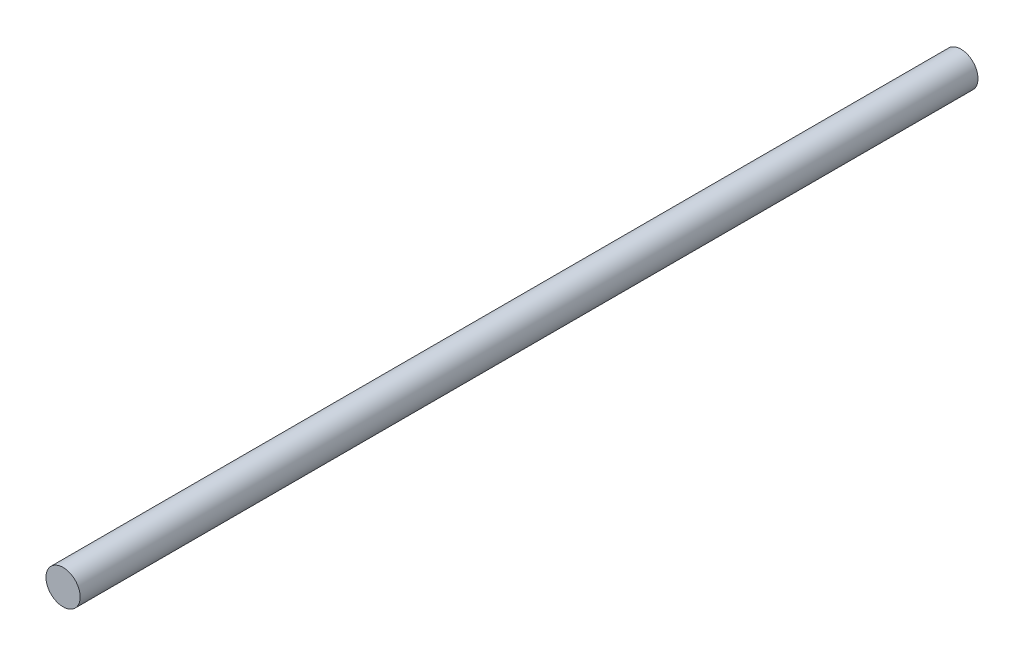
from build123d import *

# Parameters (mm, degrees)
ESQUISSE1_R      = 0.4
EXTRUSION1_DEPTH = 21


with BuildPart() as part:
    # Esquisse1 → Extrusion1 (new body)
    with BuildSketch(Plane.XY):
        Circle(ESQUISSE1_R)
    extrude(amount=EXTRUSION1_DEPTH)


solid = part.part
